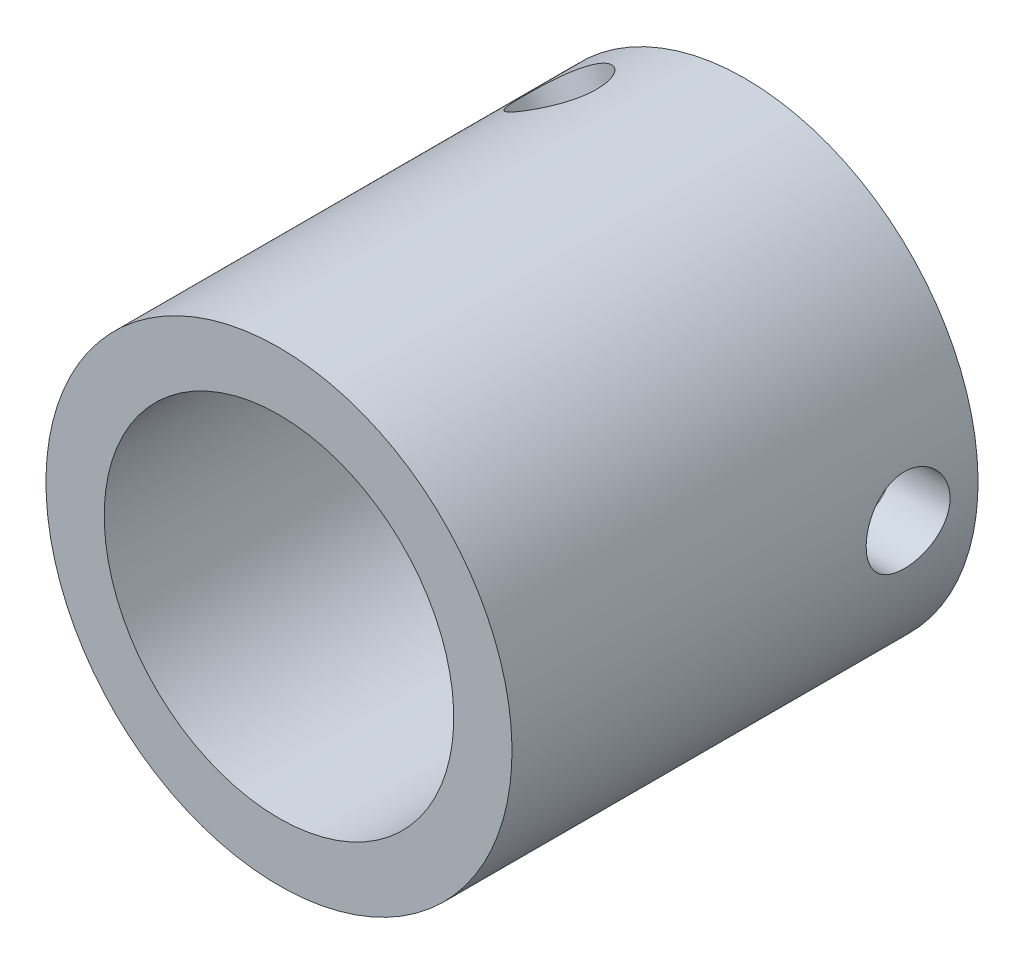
ISO-10303-21;
HEADER;
FILE_DESCRIPTION(('STEP AP214'),'2;1');
FILE_NAME('part.step','',(''),(''),'','','');
FILE_SCHEMA(('AUTOMOTIVE_DESIGN { 1 0 10303 214 1 1 1 1 }'));
ENDSEC;
DATA;
#1=APPLICATION_CONTEXT('core data for automotive mechanical design processes');
#2=APPLICATION_PROTOCOL_DEFINITION('international standard','automotive_design',2000,#1);
#3=PRODUCT_CONTEXT('',#1,'mechanical');
#4=PRODUCT('Part','Part','',(#3));
#5=PRODUCT_RELATED_PRODUCT_CATEGORY('part','',(#4));
#6=PRODUCT_DEFINITION_FORMATION('','',#4);
#7=PRODUCT_DEFINITION_CONTEXT('part definition',#1,'design');
#8=PRODUCT_DEFINITION('design','',#6,#7);
#9=PRODUCT_DEFINITION_SHAPE('','',#8);
#10=(LENGTH_UNIT() NAMED_UNIT(*) SI_UNIT(.MILLI.,.METRE.));
#11=(NAMED_UNIT(*) PLANE_ANGLE_UNIT() SI_UNIT($,.RADIAN.));
#12=(NAMED_UNIT(*) SI_UNIT($,.STERADIAN.) SOLID_ANGLE_UNIT());
#13=UNCERTAINTY_MEASURE_WITH_UNIT(LENGTH_MEASURE(1.E-05),#10,'distance_accuracy_value','');
#14=(GEOMETRIC_REPRESENTATION_CONTEXT(3) GLOBAL_UNCERTAINTY_ASSIGNED_CONTEXT((#13)) GLOBAL_UNIT_ASSIGNED_CONTEXT((#10,
#11,#12)) REPRESENTATION_CONTEXT('',''));
#15=CARTESIAN_POINT('',(0.,0.,0.));
#16=DIRECTION('',(0.,0.,1.));
#17=DIRECTION('',(1.,0.,0.));
#18=AXIS2_PLACEMENT_3D('',#15,#16,#17);
#19=CARTESIAN_POINT('',(10.,0.,3.));
#20=DIRECTION('',(1.,0.,0.));
#21=DIRECTION('',(0.,0.,1.));
#22=AXIS2_PLACEMENT_3D('',#19,#20,#21);
#23=CYLINDRICAL_SURFACE('',#22,1.8);
#24=CARTESIAN_POINT('',(7.5,0.,1.2));
#25=CARTESIAN_POINT('',(7.49999717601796,-0.0994655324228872,1.2000050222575));
#26=CARTESIAN_POINT('',(7.49799928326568,-0.199049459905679,1.20828079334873));
#27=CARTESIAN_POINT('',(7.49021476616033,-0.395458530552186,1.24114737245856));
#28=CARTESIAN_POINT('',(7.48442092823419,-0.492278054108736,1.26576924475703));
#29=CARTESIAN_POINT('',(7.4696882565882,-0.680163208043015,1.33050022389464));
#30=CARTESIAN_POINT('',(7.46075461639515,-0.771238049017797,1.37058376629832));
#31=CARTESIAN_POINT('',(7.44070033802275,-0.945340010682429,1.46502691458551));
#32=CARTESIAN_POINT('',(7.42958029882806,-1.02836932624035,1.51938261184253));
#33=CARTESIAN_POINT('',(7.40612348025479,-1.1856531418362,1.64193681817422));
#34=CARTESIAN_POINT('',(7.39376902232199,-1.25973158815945,1.71035792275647));
#35=CARTESIAN_POINT('',(7.36935512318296,-1.39548318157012,1.85862695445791));
#36=CARTESIAN_POINT('',(7.35729572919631,-1.45715435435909,1.93847669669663));
#37=CARTESIAN_POINT('',(7.33466273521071,-1.56714016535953,2.10866784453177));
#38=CARTESIAN_POINT('',(7.32411146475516,-1.6152626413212,2.19913667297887));
#39=CARTESIAN_POINT('',(7.30594394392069,-1.69554975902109,2.38717267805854));
#40=CARTESIAN_POINT('',(7.29832724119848,-1.72771686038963,2.48473875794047));
#41=CARTESIAN_POINT('',(7.28707108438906,-1.77459033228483,2.68228588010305));
#42=CARTESIAN_POINT('',(7.2833604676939,-1.78960955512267,2.78218854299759));
#43=CARTESIAN_POINT('',(7.28012337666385,-1.80273485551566,2.98315929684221));
#44=CARTESIAN_POINT('',(7.28059628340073,-1.80084343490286,3.08422721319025));
#45=CARTESIAN_POINT('',(7.28560867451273,-1.78045150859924,3.28228524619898));
#46=CARTESIAN_POINT('',(7.29005762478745,-1.76232075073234,3.37931607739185));
#47=CARTESIAN_POINT('',(7.30237697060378,-1.71055307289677,3.56891775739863));
#48=CARTESIAN_POINT('',(7.31024761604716,-1.67691502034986,3.6614882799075));
#49=CARTESIAN_POINT('',(7.32860892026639,-1.59476333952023,3.84055086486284));
#50=CARTESIAN_POINT('',(7.33912358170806,-1.54611244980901,3.92697738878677));
#51=CARTESIAN_POINT('',(7.36157332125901,-1.43541577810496,4.09056800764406));
#52=CARTESIAN_POINT('',(7.3735085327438,-1.37336873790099,4.16773123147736));
#53=CARTESIAN_POINT('',(7.39783672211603,-1.23572345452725,4.31272124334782));
#54=CARTESIAN_POINT('',(7.41023352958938,-1.1598145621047,4.38025278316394));
#55=CARTESIAN_POINT('',(7.43381254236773,-0.997567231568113,4.50170901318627));
#56=CARTESIAN_POINT('',(7.44499422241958,-0.911224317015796,4.55562783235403));
#57=CARTESIAN_POINT('',(7.46493333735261,-0.730134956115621,4.64842271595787));
#58=CARTESIAN_POINT('',(7.47368158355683,-0.635358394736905,4.68724197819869));
#59=CARTESIAN_POINT('',(7.48768731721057,-0.44048583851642,4.7482433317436));
#60=CARTESIAN_POINT('',(7.49295208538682,-0.340401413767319,4.77046013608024));
#61=CARTESIAN_POINT('',(7.49744983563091,-0.199588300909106,4.78934936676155));
#62=CARTESIAN_POINT('',(7.49840384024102,-0.159787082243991,4.79333959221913));
#63=CARTESIAN_POINT('',(7.4996794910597,-0.0799969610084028,4.7986659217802));
#64=CARTESIAN_POINT('',(7.50000113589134,-0.0400080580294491,4.8000020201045));
#65=CARTESIAN_POINT('',(7.49999717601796,0.0994655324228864,4.7999949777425));
#66=CARTESIAN_POINT('',(7.49799928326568,0.199049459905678,4.79171920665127));
#67=CARTESIAN_POINT('',(7.49021476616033,0.395458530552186,4.75885262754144));
#68=CARTESIAN_POINT('',(7.48442092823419,0.492278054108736,4.73423075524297));
#69=CARTESIAN_POINT('',(7.4696882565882,0.680163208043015,4.66949977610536));
#70=CARTESIAN_POINT('',(7.46075461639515,0.771238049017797,4.62941623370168));
#71=CARTESIAN_POINT('',(7.44070033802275,0.945340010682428,4.53497308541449));
#72=CARTESIAN_POINT('',(7.42958029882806,1.02836932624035,4.48061738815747));
#73=CARTESIAN_POINT('',(7.40612348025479,1.1856531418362,4.35806318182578));
#74=CARTESIAN_POINT('',(7.39376902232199,1.25973158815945,4.28964207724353));
#75=CARTESIAN_POINT('',(7.36935512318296,1.39548318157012,4.14137304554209));
#76=CARTESIAN_POINT('',(7.35729572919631,1.45715435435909,4.06152330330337));
#77=CARTESIAN_POINT('',(7.33466273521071,1.56714016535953,3.89133215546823));
#78=CARTESIAN_POINT('',(7.32411146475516,1.6152626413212,3.80086332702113));
#79=CARTESIAN_POINT('',(7.30594394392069,1.69554975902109,3.61282732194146));
#80=CARTESIAN_POINT('',(7.29832724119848,1.72771686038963,3.51526124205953));
#81=CARTESIAN_POINT('',(7.28707108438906,1.77459033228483,3.31771411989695));
#82=CARTESIAN_POINT('',(7.2833604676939,1.78960955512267,3.21781145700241));
#83=CARTESIAN_POINT('',(7.28012337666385,1.80273485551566,3.01684070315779));
#84=CARTESIAN_POINT('',(7.28059628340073,1.80084343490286,2.91577278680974));
#85=CARTESIAN_POINT('',(7.28560867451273,1.78045150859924,2.71771475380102));
#86=CARTESIAN_POINT('',(7.29005762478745,1.76232075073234,2.62068392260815));
#87=CARTESIAN_POINT('',(7.30237697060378,1.71055307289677,2.43108224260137));
#88=CARTESIAN_POINT('',(7.31024761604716,1.67691502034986,2.3385117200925));
#89=CARTESIAN_POINT('',(7.32860892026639,1.59476333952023,2.15944913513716));
#90=CARTESIAN_POINT('',(7.33912358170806,1.54611244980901,2.07302261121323));
#91=CARTESIAN_POINT('',(7.36157332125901,1.43541577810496,1.90943199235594));
#92=CARTESIAN_POINT('',(7.3735085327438,1.37336873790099,1.83226876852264));
#93=CARTESIAN_POINT('',(7.39783672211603,1.23572345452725,1.68727875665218));
#94=CARTESIAN_POINT('',(7.41023352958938,1.1598145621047,1.61974721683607));
#95=CARTESIAN_POINT('',(7.43381254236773,0.997567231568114,1.49829098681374));
#96=CARTESIAN_POINT('',(7.44499422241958,0.911224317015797,1.44437216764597));
#97=CARTESIAN_POINT('',(7.46493333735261,0.730134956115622,1.35157728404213));
#98=CARTESIAN_POINT('',(7.47368158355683,0.635358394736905,1.31275802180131));
#99=CARTESIAN_POINT('',(7.48768731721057,0.44048583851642,1.2517566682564));
#100=CARTESIAN_POINT('',(7.49295208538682,0.34040141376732,1.22953986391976));
#101=CARTESIAN_POINT('',(7.49744983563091,0.199588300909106,1.21065063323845));
#102=CARTESIAN_POINT('',(7.49840384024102,0.159787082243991,1.20666040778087));
#103=CARTESIAN_POINT('',(7.4996794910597,0.0799969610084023,1.2013340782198));
#104=CARTESIAN_POINT('',(7.50000113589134,0.0400080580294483,1.1999979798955));
#105=CARTESIAN_POINT('',(7.5,0.,1.2));
#106=B_SPLINE_CURVE_WITH_KNOTS('',3,(#24,#25,#26,#27,#28,#29,#30,#31,#32,#33,#34,#35,#36,#37,
#38,#39,#40,#41,#42,#43,#44,#45,#46,#47,#48,#49,#50,#51,#52,#53,#54,#55,#56,#57,#58,#59,#60,#61,
#62,#63,#64,#65,#66,#67,#68,#69,#70,#71,#72,#73,#74,#75,#76,#77,#78,#79,#80,#81,#82,#83,#84,#85,
#86,#87,#88,#89,#90,#91,#92,#93,#94,#95,#96,#97,#98,#99,#100,#101,#102,#103,#104,#105),
.UNSPECIFIED.,.T.,.F.,(4,2,2,2,2,2,2,2,2,2,2,2,2,2,2,2,2,2,2,2,2,2,2,2,2,2,2,2,2,2,2,2,2,2,2,2,
2,2,2,2,4),(0.,0.298243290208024,0.59705499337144,0.895374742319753,1.19361287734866,
1.49699515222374,1.80042566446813,2.10796479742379,2.41545650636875,2.71724378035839,
3.01898640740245,3.3140286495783,3.60909244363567,3.90693819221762,4.20481192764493,
4.51043793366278,4.81619552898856,5.1230924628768,5.42934591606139,5.54930816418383,
5.66927067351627,5.96751396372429,6.26632566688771,6.56464541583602,6.86288355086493,
7.16626582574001,7.4696963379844,7.77723547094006,8.08472717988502,8.38651445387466,
8.68825708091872,8.98329932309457,9.27836311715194,9.57620886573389,9.8740826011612,
10.1797086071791,10.4854662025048,10.7923631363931,11.0986165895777,11.2185788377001,
11.3385413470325),.UNSPECIFIED.);
#107=CARTESIAN_POINT('',(7.5,0.,1.2));
#108=VERTEX_POINT('',#107);
#109=EDGE_CURVE('E16',#108,#108,#106,.T.);
#110=ORIENTED_EDGE('',*,*,#109,.T.);
#111=EDGE_LOOP('',(#110));
#112=FACE_BOUND('',#111,.T.);
#113=CARTESIAN_POINT('',(10.,0.,1.2));
#114=CARTESIAN_POINT('',(9.99999792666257,-0.100138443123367,1.20000468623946));
#115=CARTESIAN_POINT('',(9.99847890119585,-0.200403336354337,1.20839204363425));
#116=CARTESIAN_POINT('',(9.99256124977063,-0.398189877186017,1.2417225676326));
#117=CARTESIAN_POINT('',(9.98815683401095,-0.495705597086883,1.26669902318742));
#118=CARTESIAN_POINT('',(9.97696172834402,-0.684989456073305,1.33242473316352));
#119=CARTESIAN_POINT('',(9.9701741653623,-0.776764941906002,1.37315332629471));
#120=CARTESIAN_POINT('',(9.95495763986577,-0.952142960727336,1.46917704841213));
#121=CARTESIAN_POINT('',(9.9465292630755,-1.03574839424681,1.52446698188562));
#122=CARTESIAN_POINT('',(9.92885621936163,-1.19338882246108,1.64870648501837));
#123=CARTESIAN_POINT('',(9.91960421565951,-1.26731946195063,1.7177874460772));
#124=CARTESIAN_POINT('',(9.90138142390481,-1.40261092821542,1.86736851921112));
#125=CARTESIAN_POINT('',(9.89241066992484,-1.46397023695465,1.94787000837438));
#126=CARTESIAN_POINT('',(9.87569637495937,-1.57279517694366,2.11872462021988));
#127=CARTESIAN_POINT('',(9.86796217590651,-1.6201571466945,2.20914476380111));
#128=CARTESIAN_POINT('',(9.85469826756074,-1.69897904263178,2.39681974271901));
#129=CARTESIAN_POINT('',(9.84916836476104,-1.73044036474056,2.49407397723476));
#130=CARTESIAN_POINT('',(9.84101185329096,-1.77623939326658,2.6915561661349));
#131=CARTESIAN_POINT('',(9.8383548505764,-1.79075649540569,2.79174123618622));
#132=CARTESIAN_POINT('',(9.83615323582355,-1.80281159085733,2.99315783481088));
#133=CARTESIAN_POINT('',(9.83660837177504,-1.80035095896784,3.09438927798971));
#134=CARTESIAN_POINT('',(9.84055190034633,-1.77866619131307,3.29373143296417));
#135=CARTESIAN_POINT('',(9.84400352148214,-1.75964526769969,3.39186508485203));
#136=CARTESIAN_POINT('',(9.85349347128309,-1.70569919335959,3.5835259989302));
#137=CARTESIAN_POINT('',(9.85953192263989,-1.67077328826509,3.67705304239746));
#138=CARTESIAN_POINT('',(9.87355429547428,-1.58580593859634,3.85744754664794));
#139=CARTESIAN_POINT('',(9.88154890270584,-1.53568109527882,3.94427486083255));
#140=CARTESIAN_POINT('',(9.89857482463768,-1.42180184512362,4.10835629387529));
#141=CARTESIAN_POINT('',(9.90760615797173,-1.35804719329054,4.18561024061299));
#142=CARTESIAN_POINT('',(9.92584751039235,-1.21763063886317,4.32952111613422));
#143=CARTESIAN_POINT('',(9.93505823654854,-1.14079701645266,4.39601049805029));
#144=CARTESIAN_POINT('',(9.95250580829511,-0.976936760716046,4.51520980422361));
#145=CARTESIAN_POINT('',(9.96074222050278,-0.889905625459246,4.56791360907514));
#146=CARTESIAN_POINT('',(9.97532870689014,-0.707929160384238,4.65806284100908));
#147=CARTESIAN_POINT('',(9.98167520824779,-0.612969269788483,4.69547941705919));
#148=CARTESIAN_POINT('',(9.99172969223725,-0.418096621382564,4.75370936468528));
#149=CARTESIAN_POINT('',(9.99544322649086,-0.318194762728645,4.77455768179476));
#150=CARTESIAN_POINT('',(9.99842222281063,-0.181296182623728,4.79121663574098));
#151=CARTESIAN_POINT('',(9.99901260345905,-0.145122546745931,4.79450767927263));
#152=CARTESIAN_POINT('',(9.99980186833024,-0.0726381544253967,4.7989002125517));
#153=CARTESIAN_POINT('',(10.0000007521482,-0.0363273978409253,4.80000170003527));
#154=CARTESIAN_POINT('',(9.99999792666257,0.100138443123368,4.79999531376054));
#155=CARTESIAN_POINT('',(9.99847890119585,0.200403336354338,4.79160795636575));
#156=CARTESIAN_POINT('',(9.99256124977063,0.398189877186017,4.7582774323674));
#157=CARTESIAN_POINT('',(9.98815683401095,0.495705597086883,4.73330097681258));
#158=CARTESIAN_POINT('',(9.97696172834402,0.684989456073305,4.66757526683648));
#159=CARTESIAN_POINT('',(9.9701741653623,0.776764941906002,4.62684667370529));
#160=CARTESIAN_POINT('',(9.95495763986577,0.952142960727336,4.53082295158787));
#161=CARTESIAN_POINT('',(9.9465292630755,1.03574839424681,4.47553301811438));
#162=CARTESIAN_POINT('',(9.92885621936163,1.19338882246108,4.35129351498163));
#163=CARTESIAN_POINT('',(9.91960421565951,1.26731946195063,4.2822125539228));
#164=CARTESIAN_POINT('',(9.90138142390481,1.40261092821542,4.13263148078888));
#165=CARTESIAN_POINT('',(9.89241066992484,1.46397023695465,4.05212999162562));
#166=CARTESIAN_POINT('',(9.87569637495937,1.57279517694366,3.88127537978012));
#167=CARTESIAN_POINT('',(9.86796217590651,1.6201571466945,3.79085523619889));
#168=CARTESIAN_POINT('',(9.85469826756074,1.69897904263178,3.60318025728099));
#169=CARTESIAN_POINT('',(9.84916836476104,1.73044036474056,3.50592602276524));
#170=CARTESIAN_POINT('',(9.84101185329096,1.77623939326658,3.3084438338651));
#171=CARTESIAN_POINT('',(9.8383548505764,1.79075649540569,3.20825876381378));
#172=CARTESIAN_POINT('',(9.83615323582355,1.80281159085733,3.00684216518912));
#173=CARTESIAN_POINT('',(9.83660837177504,1.80035095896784,2.90561072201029));
#174=CARTESIAN_POINT('',(9.84055190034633,1.77866619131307,2.70626856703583));
#175=CARTESIAN_POINT('',(9.84400352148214,1.75964526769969,2.60813491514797));
#176=CARTESIAN_POINT('',(9.85349347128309,1.70569919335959,2.4164740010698));
#177=CARTESIAN_POINT('',(9.85953192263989,1.67077328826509,2.32294695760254));
#178=CARTESIAN_POINT('',(9.87355429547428,1.58580593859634,2.14255245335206));
#179=CARTESIAN_POINT('',(9.88154890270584,1.53568109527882,2.05572513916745));
#180=CARTESIAN_POINT('',(9.89857482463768,1.42180184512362,1.89164370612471));
#181=CARTESIAN_POINT('',(9.90760615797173,1.35804719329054,1.81438975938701));
#182=CARTESIAN_POINT('',(9.92584751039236,1.21763063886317,1.67047888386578));
#183=CARTESIAN_POINT('',(9.93505823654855,1.14079701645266,1.60398950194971));
#184=CARTESIAN_POINT('',(9.95250580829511,0.976936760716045,1.48479019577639));
#185=CARTESIAN_POINT('',(9.96074222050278,0.889905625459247,1.43208639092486));
#186=CARTESIAN_POINT('',(9.97532870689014,0.707929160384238,1.34193715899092));
#187=CARTESIAN_POINT('',(9.98167520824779,0.612969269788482,1.30452058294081));
#188=CARTESIAN_POINT('',(9.99172969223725,0.418096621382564,1.24629063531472));
#189=CARTESIAN_POINT('',(9.99544322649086,0.318194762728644,1.22544231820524));
#190=CARTESIAN_POINT('',(9.99842222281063,0.181296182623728,1.20878336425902));
#191=CARTESIAN_POINT('',(9.99901260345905,0.145122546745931,1.20549232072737));
#192=CARTESIAN_POINT('',(9.99980186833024,0.0726381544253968,1.2010997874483));
#193=CARTESIAN_POINT('',(10.0000007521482,0.0363273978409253,1.19999829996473));
#194=CARTESIAN_POINT('',(10.,0.,1.2));
#195=B_SPLINE_CURVE_WITH_KNOTS('',3,(#113,#114,#115,#116,#117,#118,#119,#120,#121,#122,#123,
#124,#125,#126,#127,#128,#129,#130,#131,#132,#133,#134,#135,#136,#137,#138,#139,#140,#141,#142,
#143,#144,#145,#146,#147,#148,#149,#150,#151,#152,#153,#154,#155,#156,#157,#158,#159,#160,#161,
#162,#163,#164,#165,#166,#167,#168,#169,#170,#171,#172,#173,#174,#175,#176,#177,#178,#179,#180,
#181,#182,#183,#184,#185,#186,#187,#188,#189,#190,#191,#192,#193,#194),.UNSPECIFIED.,.T.,.F.,(4,
2,2,2,2,2,2,2,2,2,2,2,2,2,2,2,2,2,2,2,2,2,2,2,2,2,2,2,2,2,2,2,2,2,2,2,2,2,2,2,4),(0.,
0.300276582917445,0.601157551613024,0.901645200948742,1.20202578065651,1.50541792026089,
1.808846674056,2.11446927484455,2.42006504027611,2.72239510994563,3.02470069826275,
3.3233481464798,3.62200976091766,3.92234077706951,4.22267719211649,4.52731338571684,
4.83208457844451,5.13742832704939,5.44212632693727,5.55105807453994,5.65998993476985,
5.9602665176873,6.26114748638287,6.56163513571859,6.86201571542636,7.16540785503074,
7.46883660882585,7.7744592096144,8.08005497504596,8.38238504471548,8.6846906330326,
8.98333808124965,9.28199969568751,9.58233071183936,9.88266712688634,10.1873033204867,
10.4920745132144,10.7974182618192,11.1021162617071,11.2110480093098,11.3199798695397),.UNSPECIFIED.);
#196=CARTESIAN_POINT('',(10.,0.,1.2));
#197=VERTEX_POINT('',#196);
#198=EDGE_CURVE('E45',#197,#197,#195,.T.);
#199=ORIENTED_EDGE('',*,*,#198,.F.);
#200=EDGE_LOOP('',(#199));
#201=FACE_BOUND('',#200,.T.);
#202=ADVANCED_FACE('F12',(#112,#201),#23,.F.);
#203=CARTESIAN_POINT('',(0.,0.,45.4558441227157));
#204=DIRECTION('',(0.,0.,-1.));
#205=DIRECTION('',(0.,1.,0.));
#206=AXIS2_PLACEMENT_3D('',#203,#204,#205);
#207=CYLINDRICAL_SURFACE('',#206,7.5);
#208=CARTESIAN_POINT('',(0.,0.,0.));
#209=DIRECTION('',(0.,0.,-1.));
#210=DIRECTION('',(0.,1.,0.));
#211=AXIS2_PLACEMENT_3D('',#208,#209,#210);
#212=CIRCLE('',#211,7.5);
#213=CARTESIAN_POINT('',(0.,7.5,0.));
#214=VERTEX_POINT('',#213);
#215=EDGE_CURVE('E51',#214,#214,#212,.T.);
#216=ORIENTED_EDGE('',*,*,#215,.T.);
#217=EDGE_LOOP('',(#216));
#218=FACE_BOUND('',#217,.T.);
#219=CARTESIAN_POINT('',(0.,0.,20.));
#220=DIRECTION('',(0.,0.,-1.));
#221=DIRECTION('',(0.,1.,0.));
#222=AXIS2_PLACEMENT_3D('',#219,#220,#221);
#223=CIRCLE('',#222,7.5);
#224=CARTESIAN_POINT('',(0.,7.5,20.));
#225=VERTEX_POINT('',#224);
#226=EDGE_CURVE('E52',#225,#225,#223,.T.);
#227=ORIENTED_EDGE('',*,*,#226,.F.);
#228=EDGE_LOOP('',(#227));
#229=FACE_BOUND('',#228,.T.);
#230=CARTESIAN_POINT('',(-5.19924405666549,5.40535486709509,3.));
#231=CARTESIAN_POINT('',(-5.19924124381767,5.40536010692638,3.09941898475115));
#232=CARTESIAN_POINT('',(-5.19310953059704,5.4112762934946,3.19895665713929));
#233=CARTESIAN_POINT('',(-5.16867315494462,5.43461968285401,3.3952693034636));
#234=CARTESIAN_POINT('',(-5.15034519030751,5.45206892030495,3.49203861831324));
#235=CARTESIAN_POINT('',(-5.10188155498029,5.49744462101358,3.67981749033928));
#236=CARTESIAN_POINT('',(-5.07176626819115,5.5253529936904,3.77083667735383));
#237=CARTESIAN_POINT('',(-5.00025533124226,5.59014883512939,3.94484454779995));
#238=CARTESIAN_POINT('',(-4.95886267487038,5.62703392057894,4.02783535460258));
#239=CARTESIAN_POINT('',(-4.86459761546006,5.70873375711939,4.18515885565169));
#240=CARTESIAN_POINT('',(-4.81152803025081,5.75368190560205,4.2593041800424));
#241=CARTESIAN_POINT('',(-4.69526041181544,5.84894596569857,4.39518594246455));
#242=CARTESIAN_POINT('',(-4.63206093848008,5.89926264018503,4.45692061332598));
#243=CARTESIAN_POINT('',(-4.49582210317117,6.00375177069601,4.56697606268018));
#244=CARTESIAN_POINT('',(-4.42266739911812,6.05796525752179,4.61511549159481));
#245=CARTESIAN_POINT('',(-4.26874140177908,6.16739416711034,4.69543618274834));
#246=CARTESIAN_POINT('',(-4.18797120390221,6.22260944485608,4.72761973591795));
#247=CARTESIAN_POINT('',(-4.02241342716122,6.33085971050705,4.77452287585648));
#248=CARTESIAN_POINT('',(-3.93772944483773,6.38391616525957,4.78955830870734));
#249=CARTESIAN_POINT('',(-3.76532271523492,6.48709729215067,4.80272851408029));
#250=CARTESIAN_POINT('',(-3.67760038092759,6.53722236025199,4.80086557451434));
#251=CARTESIAN_POINT('',(-3.50354658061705,6.63210306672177,4.78052181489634));
#252=CARTESIAN_POINT('',(-3.4172233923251,6.67694760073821,4.76238187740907));
#253=CARTESIAN_POINT('',(-3.24675625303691,6.76148144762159,4.71054517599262));
#254=CARTESIAN_POINT('',(-3.16261242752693,6.80117046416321,4.67684751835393));
#255=CARTESIAN_POINT('',(-2.99835935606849,6.87517507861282,4.59456651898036));
#256=CARTESIAN_POINT('',(-2.91829058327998,6.90944202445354,4.5458588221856));
#257=CARTESIAN_POINT('',(-2.76544104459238,6.97202745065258,4.43503760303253));
#258=CARTESIAN_POINT('',(-2.69266096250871,7.0003453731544,4.37292282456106));
#259=CARTESIAN_POINT('',(-2.5550065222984,7.05177153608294,4.23522521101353));
#260=CARTESIAN_POINT('',(-2.49037310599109,7.07473309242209,4.1593464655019));
#261=CARTESIAN_POINT('',(-2.37343363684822,7.1148188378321,3.99718817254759));
#262=CARTESIAN_POINT('',(-2.32113305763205,7.13194043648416,3.91090403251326));
#263=CARTESIAN_POINT('',(-2.23067327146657,7.1607520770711,3.72983867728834));
#264=CARTESIAN_POINT('',(-2.19258506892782,7.17241491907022,3.63501766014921));
#265=CARTESIAN_POINT('',(-2.13259845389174,7.19048128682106,3.44004714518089));
#266=CARTESIAN_POINT('',(-2.11066594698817,7.19689589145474,3.33990934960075));
#267=CARTESIAN_POINT('',(-2.09204111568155,7.20231790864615,3.19913141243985));
#268=CARTESIAN_POINT('',(-2.0881124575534,7.20345708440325,3.15942117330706));
#269=CARTESIAN_POINT('',(-2.08286700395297,7.20497552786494,3.07981366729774));
#270=CARTESIAN_POINT('',(-2.08155021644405,7.20535479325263,3.03991639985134));
#271=CARTESIAN_POINT('',(-2.08155854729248,7.20535505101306,2.90058101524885));
#272=CARTESIAN_POINT('',(-2.08974797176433,7.20300292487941,2.8010433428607));
#273=CARTESIAN_POINT('',(-2.12218212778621,7.19351209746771,2.60473069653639));
#274=CARTESIAN_POINT('',(-2.14645759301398,7.18636423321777,2.50796138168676));
#275=CARTESIAN_POINT('',(-2.2099859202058,7.16708134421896,2.32018250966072));
#276=CARTESIAN_POINT('',(-2.24921292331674,7.15495492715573,2.22916332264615));
#277=CARTESIAN_POINT('',(-2.34108323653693,7.12542255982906,2.05515545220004));
#278=CARTESIAN_POINT('',(-2.39372298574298,7.10801801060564,1.97216464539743));
#279=CARTESIAN_POINT('',(-2.51160964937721,7.06723199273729,1.81484114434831));
#280=CARTESIAN_POINT('',(-2.57707068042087,7.04374645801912,1.74069581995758));
#281=CARTESIAN_POINT('',(-2.71770558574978,6.99068777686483,1.60481405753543));
#282=CARTESIAN_POINT('',(-2.79288084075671,6.96111376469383,1.54307938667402));
#283=CARTESIAN_POINT('',(-2.95149049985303,6.89537203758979,1.43302393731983));
#284=CARTESIAN_POINT('',(-3.0350181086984,6.85912494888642,1.38488450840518));
#285=CARTESIAN_POINT('',(-3.20674932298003,6.78053557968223,1.30456381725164));
#286=CARTESIAN_POINT('',(-3.2949522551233,6.73819417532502,1.27238026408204));
#287=CARTESIAN_POINT('',(-3.47147862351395,6.64894206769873,1.22547712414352));
#288=CARTESIAN_POINT('',(-3.55976885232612,6.60213181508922,1.21044169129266));
#289=CARTESIAN_POINT('',(-3.73532969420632,6.50441377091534,1.1972714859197));
#290=CARTESIAN_POINT('',(-3.82260044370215,6.45350653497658,1.19913442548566));
#291=CARTESIAN_POINT('',(-3.99179644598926,6.35021187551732,1.21947818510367));
#292=CARTESIAN_POINT('',(-4.07379454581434,6.29787606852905,1.23761812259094));
#293=CARTESIAN_POINT('',(-4.23223657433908,6.1925141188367,1.28945482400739));
#294=CARTESIAN_POINT('',(-4.30868018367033,6.13948793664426,1.32315248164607));
#295=CARTESIAN_POINT('',(-4.45489659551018,6.03424291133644,1.40543348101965));
#296=CARTESIAN_POINT('',(-4.52460702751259,5.98203479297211,1.45414117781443));
#297=CARTESIAN_POINT('',(-4.65523236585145,5.88095592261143,1.56496239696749));
#298=CARTESIAN_POINT('',(-4.71614644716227,5.83208548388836,1.62707717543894));
#299=CARTESIAN_POINT('',(-4.82951003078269,5.73858632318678,1.76477478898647));
#300=CARTESIAN_POINT('',(-4.88171203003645,5.69409292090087,1.84065353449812));
#301=CARTESIAN_POINT('',(-4.97489703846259,5.61286324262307,2.00281182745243));
#302=CARTESIAN_POINT('',(-5.01587506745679,5.57613041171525,2.08909596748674));
#303=CARTESIAN_POINT('',(-5.08605657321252,5.5121957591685,2.27016132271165));
#304=CARTESIAN_POINT('',(-5.11520099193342,5.48504182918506,2.3649823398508));
#305=CARTESIAN_POINT('',(-5.16084023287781,5.44212508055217,2.55995285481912));
#306=CARTESIAN_POINT('',(-5.17736169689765,5.42633827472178,2.66009065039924));
#307=CARTESIAN_POINT('',(-5.19136971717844,5.41291970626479,2.80086858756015));
#308=CARTESIAN_POINT('',(-5.19432060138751,5.41008697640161,2.84057882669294));
#309=CARTESIAN_POINT('',(-5.19825833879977,5.40630350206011,2.92018633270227));
#310=CARTESIAN_POINT('',(-5.19924518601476,5.40535276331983,2.96008360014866));
#311=CARTESIAN_POINT('',(-5.19924405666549,5.40535486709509,3.));
#312=B_SPLINE_CURVE_WITH_KNOTS('',3,(#230,#231,#232,#233,#234,#235,#236,#237,#238,#239,#240,
#241,#242,#243,#244,#245,#246,#247,#248,#249,#250,#251,#252,#253,#254,#255,#256,#257,#258,#259,
#260,#261,#262,#263,#264,#265,#266,#267,#268,#269,#270,#271,#272,#273,#274,#275,#276,#277,#278,
#279,#280,#281,#282,#283,#284,#285,#286,#287,#288,#289,#290,#291,#292,#293,#294,#295,#296,#297,
#298,#299,#300,#301,#302,#303,#304,#305,#306,#307,#308,#309,#310,#311),.UNSPECIFIED.,.T.,.F.,(4,
2,2,2,2,2,2,2,2,2,2,2,2,2,2,2,2,2,2,2,2,2,2,2,2,2,2,2,2,2,2,2,2,2,2,2,2,2,2,2,4),(0.,
0.29810371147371,0.596778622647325,0.894939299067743,1.19302090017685,1.49658626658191,
1.80019482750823,2.10768020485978,2.41512142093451,2.71680357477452,3.01844488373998,
3.31391278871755,3.60939766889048,3.90739956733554,4.20542939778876,4.51085340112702,
4.81641270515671,5.12347875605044,5.42989491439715,5.54958222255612,5.66926989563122,
5.96737360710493,6.26604851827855,6.56420919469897,6.86229079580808,7.16585616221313,
7.46946472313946,7.77695010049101,8.08439131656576,8.38607347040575,8.68771477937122,
8.98318268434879,9.27866756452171,9.57666946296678,9.87469929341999,10.1801232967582,
10.4856826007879,10.7927486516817,11.0991648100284,11.2188521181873,11.3385397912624),.UNSPECIFIED.);
#313=CARTESIAN_POINT('',(-5.19924405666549,5.40535486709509,3.));
#314=VERTEX_POINT('',#313);
#315=EDGE_CURVE('E77',#314,#314,#312,.T.);
#316=ORIENTED_EDGE('',*,*,#315,.T.);
#317=EDGE_LOOP('',(#316));
#318=FACE_BOUND('',#317,.T.);
#319=ORIENTED_EDGE('',*,*,#109,.F.);
#320=EDGE_LOOP('',(#319));
#321=FACE_BOUND('',#320,.T.);
#322=ADVANCED_FACE('F62',(#218,#229,#318,#321),#207,.F.);
#323=CARTESIAN_POINT('',(0.,0.,20.));
#324=DIRECTION('',(0.,0.,1.));
#325=DIRECTION('',(0.,-1.,0.));
#326=AXIS2_PLACEMENT_3D('',#323,#324,#325);
#327=PLANE('',#326);
#328=ORIENTED_EDGE('',*,*,#226,.T.);
#329=EDGE_LOOP('',(#328));
#330=FACE_BOUND('',#329,.T.);
#331=CARTESIAN_POINT('',(0.,0.,20.));
#332=DIRECTION('',(0.,0.,-1.));
#333=DIRECTION('',(0.,1.,0.));
#334=AXIS2_PLACEMENT_3D('',#331,#332,#333);
#335=CIRCLE('',#334,10.);
#336=CARTESIAN_POINT('',(0.,10.,20.));
#337=VERTEX_POINT('',#336);
#338=EDGE_CURVE('E28',#337,#337,#335,.T.);
#339=ORIENTED_EDGE('',*,*,#338,.F.);
#340=EDGE_LOOP('',(#339));
#341=FACE_BOUND('',#340,.T.);
#342=ADVANCED_FACE('F64',(#330,#341),#327,.T.);
#343=CARTESIAN_POINT('',(0.,0.,0.));
#344=DIRECTION('',(0.,0.,1.));
#345=DIRECTION('',(0.,-1.,0.));
#346=AXIS2_PLACEMENT_3D('',#343,#344,#345);
#347=PLANE('',#346);
#348=ORIENTED_EDGE('',*,*,#215,.F.);
#349=EDGE_LOOP('',(#348));
#350=FACE_BOUND('',#349,.T.);
#351=CARTESIAN_POINT('',(0.,0.,0.));
#352=DIRECTION('',(0.,0.,-1.));
#353=DIRECTION('',(0.,1.,0.));
#354=AXIS2_PLACEMENT_3D('',#351,#352,#353);
#355=CIRCLE('',#354,10.);
#356=CARTESIAN_POINT('',(0.,10.,0.));
#357=VERTEX_POINT('',#356);
#358=EDGE_CURVE('E23',#357,#357,#355,.F.);
#359=ORIENTED_EDGE('',*,*,#358,.F.);
#360=EDGE_LOOP('',(#359));
#361=FACE_BOUND('',#360,.T.);
#362=ADVANCED_FACE('F71',(#350,#361),#347,.F.);
#363=CARTESIAN_POINT('',(-5.,8.66025403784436,3.));
#364=DIRECTION('',(-0.5,0.866025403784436,0.));
#365=DIRECTION('',(-0.866025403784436,-0.5,0.));
#366=AXIS2_PLACEMENT_3D('',#363,#364,#365);
#367=CYLINDRICAL_SURFACE('',#366,1.8);
#368=ORIENTED_EDGE('',*,*,#315,.F.);
#369=EDGE_LOOP('',(#368));
#370=FACE_BOUND('',#369,.T.);
#371=CARTESIAN_POINT('',(-6.4771787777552,7.6188027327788,3.));
#372=CARTESIAN_POINT('',(-6.47717580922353,7.61880698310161,2.89987639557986));
#373=CARTESIAN_POINT('',(-6.47068644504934,7.62433700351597,2.79962624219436));
#374=CARTESIAN_POINT('',(-6.44483457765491,7.64620053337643,2.60187040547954));
#375=CARTESIAN_POINT('',(-6.42544614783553,7.66255580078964,2.50437066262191));
#376=CARTESIAN_POINT('',(-6.37421453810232,7.70522498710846,2.31512059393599));
#377=CARTESIAN_POINT('',(-6.34238797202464,7.7315256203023,2.22336278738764));
#378=CARTESIAN_POINT('',(-6.26693437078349,7.79280979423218,2.04801451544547));
#379=CARTESIAN_POINT('',(-6.22331151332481,7.82779026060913,1.96442117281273));
#380=CARTESIAN_POINT('',(-6.1246056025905,7.90526230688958,1.8067676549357));
#381=CARTESIAN_POINT('',(-6.06940820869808,7.94782813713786,1.73281553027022));
#382=CARTESIAN_POINT('',(-5.94895032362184,8.03838649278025,1.5974824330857));
#383=CARTESIAN_POINT('',(-5.8836886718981,8.08637964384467,1.5361029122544));
#384=CARTESIAN_POINT('',(-5.74401420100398,8.18619010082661,1.42725636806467));
#385=CARTESIAN_POINT('',(-5.66954069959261,8.2380317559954,1.37988942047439));
#386=CARTESIAN_POINT('',(-5.5135724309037,8.34322213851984,1.30105739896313));
#387=CARTESIAN_POINT('',(-5.43207825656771,8.39657073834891,1.26959098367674));
#388=CARTESIAN_POINT('',(-5.26508535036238,8.50226626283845,1.22378199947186));
#389=CARTESIAN_POINT('',(-5.17963895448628,8.55461779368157,1.20925935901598));
#390=CARTESIAN_POINT('',(-5.00630940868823,8.6571937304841,1.19718952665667));
#391=CARTESIAN_POINT('',(-4.91842644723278,8.70741830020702,1.19964102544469));
#392=CARTESIAN_POINT('',(-4.74381824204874,8.80375038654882,1.22131086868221));
#393=CARTESIAN_POINT('',(-4.65709135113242,8.84989875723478,1.24033521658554));
#394=CARTESIAN_POINT('',(-4.48634526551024,8.93766900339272,1.29430467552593));
#395=CARTESIAN_POINT('',(-4.40232618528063,8.97929068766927,1.3292504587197));
#396=CARTESIAN_POINT('',(-4.23910830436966,9.05749423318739,1.41425989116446));
#397=CARTESIAN_POINT('',(-4.15993732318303,9.09404829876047,1.46440245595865));
#398=CARTESIAN_POINT('',(-4.00935476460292,9.16143489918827,1.57832003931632));
#399=CARTESIAN_POINT('',(-3.93794332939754,9.19226732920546,1.64209530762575));
#400=CARTESIAN_POINT('',(-3.80421461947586,9.24842115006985,1.78252710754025));
#401=CARTESIAN_POINT('',(-3.74203819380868,9.27365961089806,1.85935101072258));
#402=CARTESIAN_POINT('',(-3.63008074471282,9.31805527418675,2.02318310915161));
#403=CARTESIAN_POINT('',(-3.58030527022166,9.33720975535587,2.11019583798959));
#404=CARTESIAN_POINT('',(-3.49488097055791,9.36952004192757,2.29216608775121));
#405=CARTESIAN_POINT('',(-3.45926435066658,9.38266218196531,2.38714113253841));
#406=CARTESIAN_POINT('',(-3.40374434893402,9.40294697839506,2.58204697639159));
#407=CARTESIAN_POINT('',(-3.3838078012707,9.4101022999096,2.68196683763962));
#408=CARTESIAN_POINT('',(-3.36788185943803,9.41580493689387,2.81885406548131));
#409=CARTESIAN_POINT('',(-3.36473694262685,9.41692892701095,2.85499777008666));
#410=CARTESIAN_POINT('',(-3.36053873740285,9.41842790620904,2.9274221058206));
#411=CARTESIAN_POINT('',(-3.3594854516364,9.41880289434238,2.96370273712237));
#412=CARTESIAN_POINT('',(-3.35949248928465,9.41880228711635,3.10012360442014));
#413=CARTESIAN_POINT('',(-3.36752630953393,9.41594734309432,3.20037375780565));
#414=CARTESIAN_POINT('',(-3.39938661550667,9.40449073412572,3.39812959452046));
#415=CARTESIAN_POINT('',(-3.42324490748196,9.39587749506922,3.49562933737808));
#416=CARTESIAN_POINT('',(-3.48581331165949,9.37284421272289,3.68487940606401));
#417=CARTESIAN_POINT('',(-3.52450361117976,9.35843191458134,3.77663721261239));
#418=CARTESIAN_POINT('',(-3.61530406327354,9.32372926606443,3.95198548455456));
#419=CARTESIAN_POINT('',(-3.66740946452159,9.303440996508,4.03557882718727));
#420=CARTESIAN_POINT('',(-3.7838551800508,9.25669519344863,4.1932323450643));
#421=CARTESIAN_POINT('',(-3.84831696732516,9.23017576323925,4.26718446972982));
#422=CARTESIAN_POINT('',(-3.98697174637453,9.17113535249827,4.40251756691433));
#423=CARTESIAN_POINT('',(-4.06116586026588,9.13861367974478,4.4638970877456));
#424=CARTESIAN_POINT('',(-4.21744148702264,9.06755726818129,4.57274363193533));
#425=CARTESIAN_POINT('',(-4.29957442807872,9.02898215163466,4.62011057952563));
#426=CARTESIAN_POINT('',(-4.46865610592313,8.94650486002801,4.6989426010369));
#427=CARTESIAN_POINT('',(-4.55560443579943,8.90260313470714,4.73040901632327));
#428=CARTESIAN_POINT('',(-4.73063589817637,8.81083079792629,4.77621800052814));
#429=CARTESIAN_POINT('',(-4.81869685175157,8.76300781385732,4.79074064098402));
#430=CARTESIAN_POINT('',(-4.99419499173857,8.66418799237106,4.80281047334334));
#431=CARTESIAN_POINT('',(-5.08163222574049,8.6131914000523,4.80035897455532));
#432=CARTESIAN_POINT('',(-5.25236236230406,8.51014230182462,4.77868913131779));
#433=CARTESIAN_POINT('',(-5.33569146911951,8.45810879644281,4.75966478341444));
#434=CARTESIAN_POINT('',(-5.4970757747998,8.35412347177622,4.70569532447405));
#435=CARTESIAN_POINT('',(-5.57513075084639,8.30217165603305,4.6707495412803));
#436=CARTESIAN_POINT('',(-5.72446594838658,8.19992259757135,4.58574010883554));
#437=CARTESIAN_POINT('',(-5.79570818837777,8.14963554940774,4.53559754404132));
#438=CARTESIAN_POINT('',(-5.92935797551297,8.0529205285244,4.42167996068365));
#439=CARTESIAN_POINT('',(-5.99176536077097,8.0064926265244,4.35790469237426));
#440=CARTESIAN_POINT('',(-6.10726035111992,7.91875707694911,4.21747289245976));
#441=CARTESIAN_POINT('',(-6.16020571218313,7.87752994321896,4.14064898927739));
#442=CARTESIAN_POINT('',(-6.25463220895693,7.80276977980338,3.97681689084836));
#443=CARTESIAN_POINT('',(-6.29610821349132,7.76924019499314,3.88980416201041));
#444=CARTESIAN_POINT('',(-6.36680189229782,7.71141572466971,3.7078339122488));
#445=CARTESIAN_POINT('',(-6.39599162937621,7.68714189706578,3.61285886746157));
#446=CARTESIAN_POINT('',(-6.44131877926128,7.64920256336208,3.41795302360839));
#447=CARTESIAN_POINT('',(-6.45748374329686,7.6355146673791,3.31803316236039));
#448=CARTESIAN_POINT('',(-6.47038534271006,7.624573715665,3.18114593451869));
#449=CARTESIAN_POINT('',(-6.47293120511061,7.6224121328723,3.14500222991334));
#450=CARTESIAN_POINT('',(-6.4763284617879,7.61952587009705,3.0725778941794));
#451=CARTESIAN_POINT('',(-6.47717985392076,7.61880119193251,3.03629726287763));
#452=CARTESIAN_POINT('',(-6.4771787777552,7.6188027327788,3.));
#453=B_SPLINE_CURVE_WITH_KNOTS('',3,(#371,#372,#373,#374,#375,#376,#377,#378,#379,#380,#381,
#382,#383,#384,#385,#386,#387,#388,#389,#390,#391,#392,#393,#394,#395,#396,#397,#398,#399,#400,
#401,#402,#403,#404,#405,#406,#407,#408,#409,#410,#411,#412,#413,#414,#415,#416,#417,#418,#419,
#420,#421,#422,#423,#424,#425,#426,#427,#428,#429,#430,#431,#432,#433,#434,#435,#436,#437,#438,
#439,#440,#441,#442,#443,#444,#445,#446,#447,#448,#449,#450,#451,#452),.UNSPECIFIED.,.T.,.F.,(4,
2,2,2,2,2,2,2,2,2,2,2,2,2,2,2,2,2,2,2,2,2,2,2,2,2,2,2,2,2,2,2,2,2,2,2,2,2,2,2,4),(0.,
0.300232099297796,0.601069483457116,0.901506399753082,1.2018370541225,1.50528752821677,
1.8087730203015,2.11437635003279,2.41995389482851,2.72225341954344,3.02452962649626,
3.32331431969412,3.62211162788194,3.92248795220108,4.22286977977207,4.52744433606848,
4.83215493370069,5.13755470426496,5.44230675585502,5.55114811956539,5.65998962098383,
5.96022172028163,6.26105910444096,6.56149602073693,6.86182667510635,7.16527714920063,
7.46876264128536,7.77436597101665,8.07994351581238,8.3822430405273,8.68451924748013,
8.98330394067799,9.28210124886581,9.58247757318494,9.88285940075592,10.1874339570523,
10.4921445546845,10.7975443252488,11.1022963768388,11.2111377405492,11.3199792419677),.UNSPECIFIED.);
#454=CARTESIAN_POINT('',(-6.4771787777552,7.6188027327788,3.));
#455=VERTEX_POINT('',#454);
#456=EDGE_CURVE('E8',#455,#455,#453,.T.);
#457=ORIENTED_EDGE('',*,*,#456,.F.);
#458=EDGE_LOOP('',(#457));
#459=FACE_BOUND('',#458,.T.);
#460=ADVANCED_FACE('F36',(#370,#459),#367,.F.);
#461=CARTESIAN_POINT('',(0.,0.,20.));
#462=DIRECTION('',(0.,0.,-1.));
#463=DIRECTION('',(0.,1.,0.));
#464=AXIS2_PLACEMENT_3D('',#461,#462,#463);
#465=CYLINDRICAL_SURFACE('',#464,10.);
#466=ORIENTED_EDGE('',*,*,#338,.T.);
#467=EDGE_LOOP('',(#466));
#468=FACE_BOUND('',#467,.T.);
#469=ORIENTED_EDGE('',*,*,#456,.T.);
#470=EDGE_LOOP('',(#469));
#471=FACE_BOUND('',#470,.T.);
#472=ORIENTED_EDGE('',*,*,#358,.T.);
#473=EDGE_LOOP('',(#472));
#474=FACE_BOUND('',#473,.T.);
#475=ORIENTED_EDGE('',*,*,#198,.T.);
#476=EDGE_LOOP('',(#475));
#477=FACE_BOUND('',#476,.T.);
#478=ADVANCED_FACE('F39',(#468,#471,#474,#477),#465,.T.);
#479=CLOSED_SHELL('',(#202,#322,#342,#362,#460,#478));
#480=MANIFOLD_SOLID_BREP('B1',#479);
#481=ADVANCED_BREP_SHAPE_REPRESENTATION('',(#18,#480),#14);
#482=SHAPE_DEFINITION_REPRESENTATION(#9,#481);
ENDSEC;
END-ISO-10303-21;
